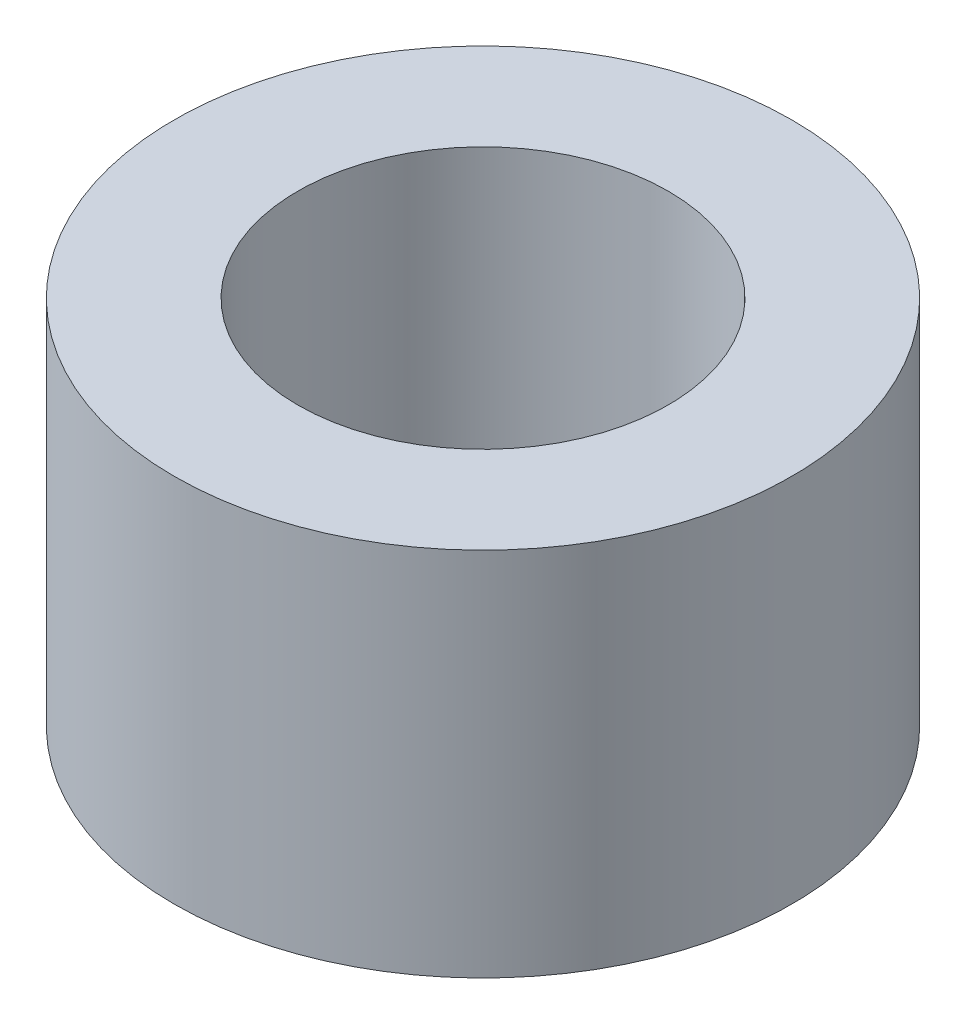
from build123d import *

# Parameters (mm, degrees)
SKETCH1_R           = 2.5
BOSS_EXTRUDE1_DEPTH = 3
SKETCH2_R           = 1.5
CUT_EXTRUDE1_DEPTH  = 5.636809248


with BuildPart() as part:
    # Sketch1 → Boss-Extrude1 (new body)
    with BuildSketch(Plane(origin=(0, 0, 0), x_dir=(1, 0, 0), z_dir=(0, 1, 0))):
        with Locations(Location((0, 0, 0), (0, 0, 270))):
            Circle(SKETCH1_R)
    extrude(amount=BOSS_EXTRUDE1_DEPTH)

    # Sketch2 → Cut-Extrude1 (cut, through all)
    with BuildSketch(Plane(origin=(0, 3, 0), x_dir=(1, 0, 0), z_dir=(0, 1, 0))):
        with Locations(Location((0, 0, 0), (0, 0, 270))):
            Circle(SKETCH2_R)
    extrude(amount=-CUT_EXTRUDE1_DEPTH, mode=Mode.SUBTRACT)


solid = part.part
